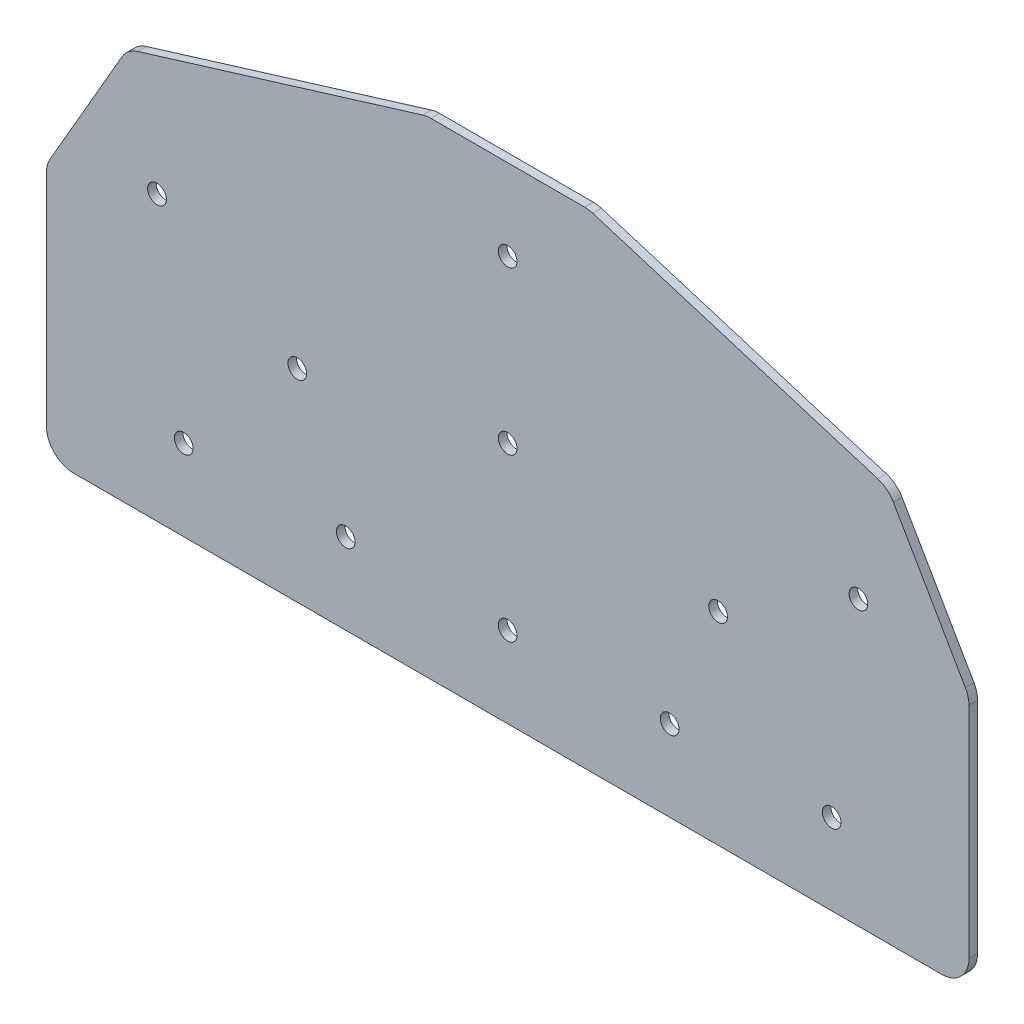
ISO-10303-21;
HEADER;
FILE_DESCRIPTION(('STEP AP214'),'2;1');
FILE_NAME('part.step','',(''),(''),'','','');
FILE_SCHEMA(('AUTOMOTIVE_DESIGN { 1 0 10303 214 1 1 1 1 }'));
ENDSEC;
DATA;
#1=APPLICATION_CONTEXT('core data for automotive mechanical design processes');
#2=APPLICATION_PROTOCOL_DEFINITION('international standard','automotive_design',2000,#1);
#3=PRODUCT_CONTEXT('',#1,'mechanical');
#4=PRODUCT('Part','Part','',(#3));
#5=PRODUCT_RELATED_PRODUCT_CATEGORY('part','',(#4));
#6=PRODUCT_DEFINITION_FORMATION('','',#4);
#7=PRODUCT_DEFINITION_CONTEXT('part definition',#1,'design');
#8=PRODUCT_DEFINITION('design','',#6,#7);
#9=PRODUCT_DEFINITION_SHAPE('','',#8);
#10=(LENGTH_UNIT() NAMED_UNIT(*) SI_UNIT(.MILLI.,.METRE.));
#11=(NAMED_UNIT(*) PLANE_ANGLE_UNIT() SI_UNIT($,.RADIAN.));
#12=(NAMED_UNIT(*) SI_UNIT($,.STERADIAN.) SOLID_ANGLE_UNIT());
#13=UNCERTAINTY_MEASURE_WITH_UNIT(LENGTH_MEASURE(1.E-05),#10,'distance_accuracy_value','');
#14=(GEOMETRIC_REPRESENTATION_CONTEXT(3) GLOBAL_UNCERTAINTY_ASSIGNED_CONTEXT((#13)) GLOBAL_UNIT_ASSIGNED_CONTEXT((#10,
#11,#12)) REPRESENTATION_CONTEXT('',''));
#15=CARTESIAN_POINT('',(0.,0.,0.));
#16=DIRECTION('',(0.,0.,1.));
#17=DIRECTION('',(1.,0.,0.));
#18=AXIS2_PLACEMENT_3D('',#15,#16,#17);
#19=CARTESIAN_POINT('',(81.3837777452,4.841875,0.));
#20=DIRECTION('',(1.,0.,0.));
#21=DIRECTION('',(0.,1.,0.));
#22=AXIS2_PLACEMENT_3D('',#19,#20,#21);
#23=PLANE('',#22);
#24=DIRECTION('',(0.,1.,0.));
#25=VECTOR('',#24,1.);
#26=CARTESIAN_POINT('',(81.3837777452,42.8625,1.524));
#27=LINE('',#26,#25);
#28=CARTESIAN_POINT('',(81.3837777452,4.84187499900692,1.524));
#29=VERTEX_POINT('',#28);
#30=CARTESIAN_POINT('',(81.3837777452,43.4792855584,1.524));
#31=VERTEX_POINT('',#30);
#32=EDGE_CURVE('E253',#29,#31,#27,.T.);
#33=ORIENTED_EDGE('',*,*,#32,.F.);
#34=DIRECTION('',(0.,0.,1.));
#35=VECTOR('',#34,1.);
#36=CARTESIAN_POINT('',(81.3837777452,4.84187499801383,0.762));
#37=LINE('',#36,#35);
#38=CARTESIAN_POINT('',(81.3837777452,4.84187499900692,0.));
#39=VERTEX_POINT('',#38);
#40=EDGE_CURVE('E152',#29,#39,#37,.F.);
#41=ORIENTED_EDGE('',*,*,#40,.T.);
#42=DIRECTION('',(0.,1.,0.));
#43=VECTOR('',#42,1.);
#44=CARTESIAN_POINT('',(81.3837777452,42.8625,0.));
#45=LINE('',#44,#43);
#46=CARTESIAN_POINT('',(81.3837777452,43.4792855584,0.));
#47=VERTEX_POINT('',#46);
#48=EDGE_CURVE('E289',#39,#47,#45,.T.);
#49=ORIENTED_EDGE('',*,*,#48,.T.);
#50=DIRECTION('',(0.,0.,-1.));
#51=VECTOR('',#50,1.);
#52=CARTESIAN_POINT('',(81.3837777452,43.4792855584,0.762));
#53=LINE('',#52,#51);
#54=EDGE_CURVE('E193',#47,#31,#53,.F.);
#55=ORIENTED_EDGE('',*,*,#54,.T.);
#56=EDGE_LOOP('',(#33,#41,#49,#55));
#57=FACE_BOUND('',#56,.T.);
#58=ADVANCED_FACE('F15',(#57),#23,.T.);
#59=CARTESIAN_POINT('',(76.5419027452,43.4792855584,0.));
#60=DIRECTION('',(0.,0.,1.));
#61=DIRECTION('',(1.,0.,0.));
#62=AXIS2_PLACEMENT_3D('',#59,#60,#61);
#63=CYLINDRICAL_SURFACE('',#62,4.84187500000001);
#64=ORIENTED_EDGE('',*,*,#54,.F.);
#65=CARTESIAN_POINT('',(76.5419027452,43.4792855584,0.));
#66=DIRECTION('',(0.,0.,1.));
#67=DIRECTION('',(1.,0.,0.));
#68=AXIS2_PLACEMENT_3D('',#65,#66,#67);
#69=CIRCLE('',#68,4.84187500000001);
#70=CARTESIAN_POINT('',(80.7350894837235,45.9002230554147,0.));
#71=VERTEX_POINT('',#70);
#72=EDGE_CURVE('E286',#47,#71,#69,.T.);
#73=ORIENTED_EDGE('',*,*,#72,.T.);
#74=DIRECTION('',(0.,0.,1.));
#75=VECTOR('',#74,1.);
#76=CARTESIAN_POINT('',(80.735089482,45.9002230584,0.762));
#77=LINE('',#76,#75);
#78=CARTESIAN_POINT('',(80.7350894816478,45.9002230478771,1.524));
#79=VERTEX_POINT('',#78);
#80=EDGE_CURVE('E190',#71,#79,#77,.T.);
#81=ORIENTED_EDGE('',*,*,#80,.T.);
#82=CARTESIAN_POINT('',(76.5419027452,43.4792855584,1.524));
#83=DIRECTION('',(0.,0.,1.));
#84=DIRECTION('',(1.,0.,0.));
#85=AXIS2_PLACEMENT_3D('',#82,#83,#84);
#86=CIRCLE('',#85,4.84187500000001);
#87=EDGE_CURVE('E251',#31,#79,#86,.T.);
#88=ORIENTED_EDGE('',*,*,#87,.F.);
#89=EDGE_LOOP('',(#64,#73,#81,#88));
#90=FACE_BOUND('',#89,.T.);
#91=ADVANCED_FACE('F345',(#90),#63,.T.);
#92=CARTESIAN_POINT('',(68.0485453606,67.873962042,0.));
#93=DIRECTION('',(-0.866025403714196,-0.500000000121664,0.));
#94=DIRECTION('',(0.500000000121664,-0.866025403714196,0.));
#95=AXIS2_PLACEMENT_3D('',#92,#93,#94);
#96=PLANE('',#95);
#97=ORIENTED_EDGE('',*,*,#80,.F.);
#98=DIRECTION('',(0.500000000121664,-0.866025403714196,0.));
#99=VECTOR('',#98,1.);
#100=CARTESIAN_POINT('',(68.0485453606,67.873962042,0.));
#101=LINE('',#100,#99);
#102=CARTESIAN_POINT('',(68.0485453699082,67.8739620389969,0.));
#103=VERTEX_POINT('',#102);
#104=EDGE_CURVE('E284',#71,#103,#101,.F.);
#105=ORIENTED_EDGE('',*,*,#104,.T.);
#106=DIRECTION('',(0.,0.,-1.));
#107=VECTOR('',#106,1.);
#108=CARTESIAN_POINT('',(68.0485453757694,67.8739620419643,0.762));
#109=LINE('',#108,#107);
#110=CARTESIAN_POINT('',(68.048545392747,67.8739620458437,1.524));
#111=VERTEX_POINT('',#110);
#112=EDGE_CURVE('E127',#103,#111,#109,.F.);
#113=ORIENTED_EDGE('',*,*,#112,.T.);
#114=DIRECTION('',(-0.499999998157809,0.866025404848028,0.));
#115=VECTOR('',#114,1.);
#116=CARTESIAN_POINT('',(80.7350894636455,45.900223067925,1.524));
#117=LINE('',#116,#115);
#118=EDGE_CURVE('E249',#79,#111,#117,.T.);
#119=ORIENTED_EDGE('',*,*,#118,.F.);
#120=EDGE_LOOP('',(#97,#105,#113,#119));
#121=FACE_BOUND('',#120,.T.);
#122=ADVANCED_FACE('F348',(#121),#96,.F.);
#123=CARTESIAN_POINT('',(63.8553586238,65.453024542,1.524));
#124=DIRECTION('',(0.,0.,-1.));
#125=DIRECTION('',(0.,1.,0.));
#126=AXIS2_PLACEMENT_3D('',#123,#124,#125);
#127=CYLINDRICAL_SURFACE('',#126,4.84187500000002);
#128=ORIENTED_EDGE('',*,*,#112,.F.);
#129=CARTESIAN_POINT('',(63.8553586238,65.453024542,0.));
#130=DIRECTION('',(0.,0.,-1.));
#131=DIRECTION('',(0.,1.,0.));
#132=AXIS2_PLACEMENT_3D('',#129,#130,#131);
#133=CIRCLE('',#132,4.84187500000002);
#134=CARTESIAN_POINT('',(65.2755061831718,70.0819482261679,0.));
#135=VERTEX_POINT('',#134);
#136=EDGE_CURVE('E19',#103,#135,#133,.F.);
#137=ORIENTED_EDGE('',*,*,#136,.T.);
#138=DIRECTION('',(0.,0.,1.));
#139=VECTOR('',#138,1.);
#140=CARTESIAN_POINT('',(65.2755061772,70.081948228,0.762));
#141=LINE('',#140,#139);
#142=CARTESIAN_POINT('',(65.2755061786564,70.081948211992,1.524));
#143=VERTEX_POINT('',#142);
#144=EDGE_CURVE('E134',#135,#143,#141,.T.);
#145=ORIENTED_EDGE('',*,*,#144,.T.);
#146=CARTESIAN_POINT('',(63.8553586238,65.453024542,1.524));
#147=DIRECTION('',(0.,0.,-1.));
#148=DIRECTION('',(0.,1.,0.));
#149=AXIS2_PLACEMENT_3D('',#146,#147,#148);
#150=CIRCLE('',#149,4.84187500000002);
#151=EDGE_CURVE('E247',#111,#143,#150,.F.);
#152=ORIENTED_EDGE('',*,*,#151,.F.);
#153=EDGE_LOOP('',(#128,#137,#145,#152));
#154=FACE_BOUND('',#153,.T.);
#155=ADVANCED_FACE('F151',(#154),#127,.T.);
#156=CARTESIAN_POINT('',(14.9816077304,85.512048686,0.));
#157=DIRECTION('',(-0.293305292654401,-0.956018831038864,0.));
#158=DIRECTION('',(0.956018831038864,-0.293305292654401,0.));
#159=AXIS2_PLACEMENT_3D('',#156,#157,#158);
#160=PLANE('',#159);
#161=ORIENTED_EDGE('',*,*,#144,.F.);
#162=DIRECTION('',(0.956018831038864,-0.293305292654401,0.));
#163=VECTOR('',#162,1.);
#164=CARTESIAN_POINT('',(14.9816077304,85.512048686,0.));
#165=LINE('',#164,#163);
#166=CARTESIAN_POINT('',(14.981607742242,85.5120486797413,0.));
#167=VERTEX_POINT('',#166);
#168=EDGE_CURVE('E138',#135,#167,#165,.F.);
#169=ORIENTED_EDGE('',*,*,#168,.T.);
#170=DIRECTION('',(0.,0.,-1.));
#171=VECTOR('',#170,1.);
#172=CARTESIAN_POINT('',(14.9816077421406,85.5120486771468,0.762));
#173=LINE('',#172,#171);
#174=CARTESIAN_POINT('',(14.9816077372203,85.5120486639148,1.524));
#175=VERTEX_POINT('',#174);
#176=EDGE_CURVE('E140',#167,#175,#173,.F.);
#177=ORIENTED_EDGE('',*,*,#176,.T.);
#178=DIRECTION('',(-0.956018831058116,0.293305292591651,0.));
#179=VECTOR('',#178,1.);
#180=CARTESIAN_POINT('',(65.2755061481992,70.081948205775,1.524));
#181=LINE('',#180,#179);
#182=EDGE_CURVE('E139',#143,#175,#181,.T.);
#183=ORIENTED_EDGE('',*,*,#182,.F.);
#184=EDGE_LOOP('',(#161,#169,#177,#183));
#185=FACE_BOUND('',#184,.T.);
#186=ADVANCED_FACE('F136',(#185),#160,.F.);
#187=CARTESIAN_POINT('',(13.561460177,80.883125,1.524));
#188=DIRECTION('',(0.,0.,-1.));
#189=DIRECTION('',(0.,1.,0.));
#190=AXIS2_PLACEMENT_3D('',#187,#188,#189);
#191=CYLINDRICAL_SURFACE('',#190,4.841875);
#192=ORIENTED_EDGE('',*,*,#176,.F.);
#193=CARTESIAN_POINT('',(13.561460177,80.883125,0.));
#194=DIRECTION('',(0.,0.,-1.));
#195=DIRECTION('',(0.,1.,0.));
#196=AXIS2_PLACEMENT_3D('',#193,#194,#195);
#197=CIRCLE('',#196,4.841875);
#198=CARTESIAN_POINT('',(13.561460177,85.725,0.));
#199=VERTEX_POINT('',#198);
#200=EDGE_CURVE('E150',#167,#199,#197,.F.);
#201=ORIENTED_EDGE('',*,*,#200,.T.);
#202=DIRECTION('',(0.,0.,1.));
#203=VECTOR('',#202,1.);
#204=CARTESIAN_POINT('',(13.561460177,85.725,0.762));
#205=LINE('',#204,#203);
#206=CARTESIAN_POINT('',(13.561460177,85.725,1.524));
#207=VERTEX_POINT('',#206);
#208=EDGE_CURVE('E185',#199,#207,#205,.T.);
#209=ORIENTED_EDGE('',*,*,#208,.T.);
#210=CARTESIAN_POINT('',(13.561460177,80.883125,1.524));
#211=DIRECTION('',(0.,0.,-1.));
#212=DIRECTION('',(0.,1.,0.));
#213=AXIS2_PLACEMENT_3D('',#210,#211,#212);
#214=CIRCLE('',#213,4.841875);
#215=EDGE_CURVE('E244',#175,#207,#214,.F.);
#216=ORIENTED_EDGE('',*,*,#215,.F.);
#217=EDGE_LOOP('',(#192,#201,#209,#216));
#218=FACE_BOUND('',#217,.T.);
#219=ADVANCED_FACE('F371',(#218),#191,.T.);
#220=CARTESIAN_POINT('',(-13.561460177,85.725,1.524));
#221=DIRECTION('',(0.,-1.,0.));
#222=DIRECTION('',(0.,0.,-1.));
#223=AXIS2_PLACEMENT_3D('',#220,#221,#222);
#224=PLANE('',#223);
#225=ORIENTED_EDGE('',*,*,#208,.F.);
#226=DIRECTION('',(-1.,0.,0.));
#227=VECTOR('',#226,1.);
#228=CARTESIAN_POINT('',(0.,85.725,0.));
#229=LINE('',#228,#227);
#230=CARTESIAN_POINT('',(-13.5614601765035,85.725,0.));
#231=VERTEX_POINT('',#230);
#232=EDGE_CURVE('E313',#199,#231,#229,.T.);
#233=ORIENTED_EDGE('',*,*,#232,.T.);
#234=DIRECTION('',(0.,0.,-1.));
#235=VECTOR('',#234,1.);
#236=CARTESIAN_POINT('',(-13.5614601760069,85.725,0.762));
#237=LINE('',#236,#235);
#238=CARTESIAN_POINT('',(-13.5614601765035,85.725,1.524));
#239=VERTEX_POINT('',#238);
#240=EDGE_CURVE('E182',#231,#239,#237,.F.);
#241=ORIENTED_EDGE('',*,*,#240,.T.);
#242=DIRECTION('',(-1.,0.,0.));
#243=VECTOR('',#242,1.);
#244=CARTESIAN_POINT('',(0.,85.725,1.524));
#245=LINE('',#244,#243);
#246=EDGE_CURVE('E243',#207,#239,#245,.T.);
#247=ORIENTED_EDGE('',*,*,#246,.F.);
#248=EDGE_LOOP('',(#225,#233,#241,#247));
#249=FACE_BOUND('',#248,.T.);
#250=ADVANCED_FACE('F369',(#249),#224,.F.);
#251=CARTESIAN_POINT('',(-13.561460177,80.883125,1.524));
#252=DIRECTION('',(0.,0.,-1.));
#253=DIRECTION('',(0.,1.,0.));
#254=AXIS2_PLACEMENT_3D('',#251,#252,#253);
#255=CYLINDRICAL_SURFACE('',#254,4.841875);
#256=ORIENTED_EDGE('',*,*,#240,.F.);
#257=CARTESIAN_POINT('',(-13.561460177,80.883125,0.));
#258=DIRECTION('',(0.,0.,-1.));
#259=DIRECTION('',(0.,1.,0.));
#260=AXIS2_PLACEMENT_3D('',#257,#258,#259);
#261=CIRCLE('',#260,4.841875);
#262=CARTESIAN_POINT('',(-14.9816077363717,85.5120486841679,0.));
#263=VERTEX_POINT('',#262);
#264=EDGE_CURVE('E310',#231,#263,#261,.F.);
#265=ORIENTED_EDGE('',*,*,#264,.T.);
#266=DIRECTION('',(0.,0.,1.));
#267=VECTOR('',#266,1.);
#268=CARTESIAN_POINT('',(-14.9816077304,85.512048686,0.762));
#269=LINE('',#268,#267);
#270=CARTESIAN_POINT('',(-14.98160773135,85.5120486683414,1.524));
#271=VERTEX_POINT('',#270);
#272=EDGE_CURVE('E179',#263,#271,#269,.T.);
#273=ORIENTED_EDGE('',*,*,#272,.T.);
#274=CARTESIAN_POINT('',(-13.561460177,80.883125,1.524));
#275=DIRECTION('',(0.,0.,-1.));
#276=DIRECTION('',(0.,1.,0.));
#277=AXIS2_PLACEMENT_3D('',#274,#275,#276);
#278=CIRCLE('',#277,4.841875);
#279=EDGE_CURVE('E241',#239,#271,#278,.F.);
#280=ORIENTED_EDGE('',*,*,#279,.F.);
#281=EDGE_LOOP('',(#256,#265,#273,#280));
#282=FACE_BOUND('',#281,.T.);
#283=ADVANCED_FACE('F366',(#282),#255,.T.);
#284=CARTESIAN_POINT('',(-65.2755061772,70.081948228,0.));
#285=DIRECTION('',(0.293305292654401,-0.956018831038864,0.));
#286=DIRECTION('',(0.956018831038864,0.293305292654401,0.));
#287=AXIS2_PLACEMENT_3D('',#284,#285,#286);
#288=PLANE('',#287);
#289=ORIENTED_EDGE('',*,*,#272,.F.);
#290=DIRECTION('',(0.956018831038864,0.293305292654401,0.));
#291=VECTOR('',#290,1.);
#292=CARTESIAN_POINT('',(-65.2755061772,70.081948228,0.));
#293=LINE('',#292,#291);
#294=CARTESIAN_POINT('',(-65.2755061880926,70.0819482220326,0.));
#295=VERTEX_POINT('',#294);
#296=EDGE_CURVE('E307',#263,#295,#293,.F.);
#297=ORIENTED_EDGE('',*,*,#296,.T.);
#298=DIRECTION('',(0.,0.,-1.));
#299=VECTOR('',#298,1.);
#300=CARTESIAN_POINT('',(-65.2755061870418,70.0819482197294,0.762));
#301=LINE('',#300,#299);
#302=CARTESIAN_POINT('',(-65.2755061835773,70.0819482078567,1.524));
#303=VERTEX_POINT('',#302);
#304=EDGE_CURVE('E176',#295,#303,#301,.F.);
#305=ORIENTED_EDGE('',*,*,#304,.T.);
#306=DIRECTION('',(-0.956018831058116,-0.293305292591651,0.));
#307=VECTOR('',#306,1.);
#308=CARTESIAN_POINT('',(-14.9816077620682,85.51204864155,1.524));
#309=LINE('',#308,#307);
#310=EDGE_CURVE('E239',#271,#303,#309,.T.);
#311=ORIENTED_EDGE('',*,*,#310,.F.);
#312=EDGE_LOOP('',(#289,#297,#305,#311));
#313=FACE_BOUND('',#312,.T.);
#314=ADVANCED_FACE('F363',(#313),#288,.F.);
#315=CARTESIAN_POINT('',(-63.8553586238,65.453024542,1.524));
#316=DIRECTION('',(0.,0.,-1.));
#317=DIRECTION('',(0.,1.,0.));
#318=AXIS2_PLACEMENT_3D('',#315,#316,#317);
#319=CYLINDRICAL_SURFACE('',#318,4.841875);
#320=ORIENTED_EDGE('',*,*,#304,.F.);
#321=CARTESIAN_POINT('',(-63.8553586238,65.453024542,0.));
#322=DIRECTION('',(0.,0.,-1.));
#323=DIRECTION('',(0.,1.,0.));
#324=AXIS2_PLACEMENT_3D('',#321,#322,#323);
#325=CIRCLE('',#324,4.841875);
#326=CARTESIAN_POINT('',(-68.0485453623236,67.8739620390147,0.));
#327=VERTEX_POINT('',#326);
#328=EDGE_CURVE('E304',#295,#327,#325,.F.);
#329=ORIENTED_EDGE('',*,*,#328,.T.);
#330=DIRECTION('',(0.,0.,1.));
#331=VECTOR('',#330,1.);
#332=CARTESIAN_POINT('',(-68.0485453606,67.873962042,0.762));
#333=LINE('',#332,#331);
#334=CARTESIAN_POINT('',(-68.0485453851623,67.8739620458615,1.524));
#335=VERTEX_POINT('',#334);
#336=EDGE_CURVE('E173',#327,#335,#333,.T.);
#337=ORIENTED_EDGE('',*,*,#336,.T.);
#338=CARTESIAN_POINT('',(-63.8553586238,65.453024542,1.524));
#339=DIRECTION('',(0.,0.,-1.));
#340=DIRECTION('',(0.,1.,0.));
#341=AXIS2_PLACEMENT_3D('',#338,#339,#340);
#342=CIRCLE('',#341,4.841875);
#343=EDGE_CURVE('E237',#303,#335,#342,.F.);
#344=ORIENTED_EDGE('',*,*,#343,.F.);
#345=EDGE_LOOP('',(#320,#329,#337,#344));
#346=FACE_BOUND('',#345,.T.);
#347=ADVANCED_FACE('F359',(#346),#319,.T.);
#348=CARTESIAN_POINT('',(-80.735089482,45.9002230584,0.));
#349=DIRECTION('',(0.866025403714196,-0.500000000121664,0.));
#350=DIRECTION('',(0.500000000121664,0.866025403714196,0.));
#351=AXIS2_PLACEMENT_3D('',#348,#349,#350);
#352=PLANE('',#351);
#353=DIRECTION('',(0.,0.,-1.));
#354=VECTOR('',#353,1.);
#355=CARTESIAN_POINT('',(-80.7350894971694,45.9002230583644,0.762));
#356=LINE('',#355,#354);
#357=CARTESIAN_POINT('',(-80.7350894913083,45.9002230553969,0.));
#358=VERTEX_POINT('',#357);
#359=CARTESIAN_POINT('',(-80.7350894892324,45.9002230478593,1.524));
#360=VERTEX_POINT('',#359);
#361=EDGE_CURVE('E170',#358,#360,#356,.F.);
#362=ORIENTED_EDGE('',*,*,#361,.T.);
#363=DIRECTION('',(-0.49999999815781,-0.866025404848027,0.));
#364=VECTOR('',#363,1.);
#365=CARTESIAN_POINT('',(-68.0485454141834,67.873962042,1.524));
#366=LINE('',#365,#364);
#367=EDGE_CURVE('E235',#335,#360,#366,.T.);
#368=ORIENTED_EDGE('',*,*,#367,.F.);
#369=ORIENTED_EDGE('',*,*,#336,.F.);
#370=DIRECTION('',(0.500000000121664,0.866025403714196,0.));
#371=VECTOR('',#370,1.);
#372=CARTESIAN_POINT('',(-80.735089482,45.9002230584,0.));
#373=LINE('',#372,#371);
#374=EDGE_CURVE('E301',#327,#358,#373,.F.);
#375=ORIENTED_EDGE('',*,*,#374,.T.);
#376=EDGE_LOOP('',(#362,#368,#369,#375));
#377=FACE_BOUND('',#376,.T.);
#378=ADVANCED_FACE('F355',(#377),#352,.F.);
#379=CARTESIAN_POINT('',(-76.5419027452,43.4792855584,0.));
#380=DIRECTION('',(0.,0.,1.));
#381=DIRECTION('',(1.,0.,0.));
#382=AXIS2_PLACEMENT_3D('',#379,#380,#381);
#383=CYLINDRICAL_SURFACE('',#382,4.84187500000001);
#384=ORIENTED_EDGE('',*,*,#361,.F.);
#385=CARTESIAN_POINT('',(-76.5419027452,43.4792855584,0.));
#386=DIRECTION('',(0.,0.,1.));
#387=DIRECTION('',(1.,0.,0.));
#388=AXIS2_PLACEMENT_3D('',#385,#386,#387);
#389=CIRCLE('',#388,4.84187500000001);
#390=CARTESIAN_POINT('',(-81.3837777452,43.4792855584,0.));
#391=VERTEX_POINT('',#390);
#392=EDGE_CURVE('E298',#358,#391,#389,.T.);
#393=ORIENTED_EDGE('',*,*,#392,.T.);
#394=DIRECTION('',(0.,0.,-1.));
#395=VECTOR('',#394,1.);
#396=CARTESIAN_POINT('',(-81.3837777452,43.4792855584,0.762));
#397=LINE('',#396,#395);
#398=CARTESIAN_POINT('',(-81.3837777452,43.4792855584,1.524));
#399=VERTEX_POINT('',#398);
#400=EDGE_CURVE('E168',#399,#391,#397,.T.);
#401=ORIENTED_EDGE('',*,*,#400,.F.);
#402=CARTESIAN_POINT('',(-76.5419027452,43.4792855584,1.524));
#403=DIRECTION('',(0.,0.,1.));
#404=DIRECTION('',(1.,0.,0.));
#405=AXIS2_PLACEMENT_3D('',#402,#403,#404);
#406=CIRCLE('',#405,4.84187500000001);
#407=EDGE_CURVE('E233',#360,#399,#406,.T.);
#408=ORIENTED_EDGE('',*,*,#407,.F.);
#409=EDGE_LOOP('',(#384,#393,#401,#408));
#410=FACE_BOUND('',#409,.T.);
#411=ADVANCED_FACE('F352',(#410),#383,.T.);
#412=CARTESIAN_POINT('',(-81.3837777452,4.841875,0.));
#413=DIRECTION('',(-1.,0.,0.));
#414=DIRECTION('',(0.,0.,1.));
#415=AXIS2_PLACEMENT_3D('',#412,#413,#414);
#416=PLANE('',#415);
#417=DIRECTION('',(0.,-1.,0.));
#418=VECTOR('',#417,1.);
#419=CARTESIAN_POINT('',(-81.3837777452,42.8625,0.));
#420=LINE('',#419,#418);
#421=CARTESIAN_POINT('',(-81.3837777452,4.84187499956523,0.));
#422=VERTEX_POINT('',#421);
#423=EDGE_CURVE('E297',#391,#422,#420,.T.);
#424=ORIENTED_EDGE('',*,*,#423,.T.);
#425=DIRECTION('',(0.,0.,-1.));
#426=VECTOR('',#425,1.);
#427=CARTESIAN_POINT('',(-81.3837777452,4.84187499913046,0.762));
#428=LINE('',#427,#426);
#429=CARTESIAN_POINT('',(-81.3837777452,4.84187499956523,1.524));
#430=VERTEX_POINT('',#429);
#431=EDGE_CURVE('E165',#422,#430,#428,.F.);
#432=ORIENTED_EDGE('',*,*,#431,.T.);
#433=DIRECTION('',(0.,-1.,0.));
#434=VECTOR('',#433,1.);
#435=CARTESIAN_POINT('',(-81.3837777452,42.8625,1.524));
#436=LINE('',#435,#434);
#437=EDGE_CURVE('E232',#399,#430,#436,.T.);
#438=ORIENTED_EDGE('',*,*,#437,.F.);
#439=ORIENTED_EDGE('',*,*,#400,.T.);
#440=EDGE_LOOP('',(#424,#432,#438,#439));
#441=FACE_BOUND('',#440,.T.);
#442=ADVANCED_FACE('F331',(#441),#416,.T.);
#443=CARTESIAN_POINT('',(-76.5419027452,4.841875,1.524));
#444=DIRECTION('',(0.,0.,-1.));
#445=DIRECTION('',(0.,1.,0.));
#446=AXIS2_PLACEMENT_3D('',#443,#444,#445);
#447=CYLINDRICAL_SURFACE('',#446,4.84187500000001);
#448=DIRECTION('',(0.,0.,1.));
#449=VECTOR('',#448,1.);
#450=CARTESIAN_POINT('',(-76.5419027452,0.,0.762));
#451=LINE('',#450,#449);
#452=CARTESIAN_POINT('',(-76.5419027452,0.,0.));
#453=VERTEX_POINT('',#452);
#454=CARTESIAN_POINT('',(-76.5419027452,0.,1.524));
#455=VERTEX_POINT('',#454);
#456=EDGE_CURVE('E159',#453,#455,#451,.T.);
#457=ORIENTED_EDGE('',*,*,#456,.T.);
#458=CARTESIAN_POINT('',(-76.5419027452,4.841875,1.524));
#459=DIRECTION('',(0.,0.,-1.));
#460=DIRECTION('',(0.,1.,0.));
#461=AXIS2_PLACEMENT_3D('',#458,#459,#460);
#462=CIRCLE('',#461,4.84187500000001);
#463=EDGE_CURVE('E230',#430,#455,#462,.F.);
#464=ORIENTED_EDGE('',*,*,#463,.F.);
#465=ORIENTED_EDGE('',*,*,#431,.F.);
#466=CARTESIAN_POINT('',(-76.5419027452,4.841875,0.));
#467=DIRECTION('',(0.,0.,-1.));
#468=DIRECTION('',(0.,1.,0.));
#469=AXIS2_PLACEMENT_3D('',#466,#467,#468);
#470=CIRCLE('',#469,4.84187500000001);
#471=EDGE_CURVE('E294',#422,#453,#470,.F.);
#472=ORIENTED_EDGE('',*,*,#471,.T.);
#473=EDGE_LOOP('',(#457,#464,#465,#472));
#474=FACE_BOUND('',#473,.T.);
#475=ADVANCED_FACE('F335',(#474),#447,.T.);
#476=CARTESIAN_POINT('',(76.5419027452,0.,0.));
#477=DIRECTION('',(0.,1.,0.));
#478=DIRECTION('',(-1.,0.,0.));
#479=AXIS2_PLACEMENT_3D('',#476,#477,#478);
#480=PLANE('',#479);
#481=DIRECTION('',(0.,0.,-1.));
#482=VECTOR('',#481,1.);
#483=CARTESIAN_POINT('',(76.5419027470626,0.,0.762));
#484=LINE('',#483,#482);
#485=CARTESIAN_POINT('',(76.5419027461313,0.,0.));
#486=VERTEX_POINT('',#485);
#487=CARTESIAN_POINT('',(76.5419027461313,0.,1.524));
#488=VERTEX_POINT('',#487);
#489=EDGE_CURVE('E153',#486,#488,#484,.F.);
#490=ORIENTED_EDGE('',*,*,#489,.T.);
#491=DIRECTION('',(1.,0.,0.));
#492=VECTOR('',#491,1.);
#493=CARTESIAN_POINT('',(0.,0.,1.524));
#494=LINE('',#493,#492);
#495=EDGE_CURVE('E34',#455,#488,#494,.T.);
#496=ORIENTED_EDGE('',*,*,#495,.F.);
#497=ORIENTED_EDGE('',*,*,#456,.F.);
#498=DIRECTION('',(1.,0.,0.));
#499=VECTOR('',#498,1.);
#500=CARTESIAN_POINT('',(0.,0.,0.));
#501=LINE('',#500,#499);
#502=EDGE_CURVE('E293',#453,#486,#501,.T.);
#503=ORIENTED_EDGE('',*,*,#502,.T.);
#504=EDGE_LOOP('',(#490,#496,#497,#503));
#505=FACE_BOUND('',#504,.T.);
#506=ADVANCED_FACE('F338',(#505),#480,.F.);
#507=CARTESIAN_POINT('',(76.5419027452,4.841875,1.524));
#508=DIRECTION('',(0.,0.,-1.));
#509=DIRECTION('',(0.,1.,0.));
#510=AXIS2_PLACEMENT_3D('',#507,#508,#509);
#511=CYLINDRICAL_SURFACE('',#510,4.84187500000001);
#512=ORIENTED_EDGE('',*,*,#40,.F.);
#513=CARTESIAN_POINT('',(76.5419027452,4.841875,1.524));
#514=DIRECTION('',(0.,0.,-1.));
#515=DIRECTION('',(0.,1.,0.));
#516=AXIS2_PLACEMENT_3D('',#513,#514,#515);
#517=CIRCLE('',#516,4.84187500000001);
#518=EDGE_CURVE('E228',#488,#29,#517,.F.);
#519=ORIENTED_EDGE('',*,*,#518,.F.);
#520=ORIENTED_EDGE('',*,*,#489,.F.);
#521=CARTESIAN_POINT('',(76.5419027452,4.841875,0.));
#522=DIRECTION('',(0.,0.,-1.));
#523=DIRECTION('',(0.,1.,0.));
#524=AXIS2_PLACEMENT_3D('',#521,#522,#523);
#525=CIRCLE('',#524,4.84187500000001);
#526=EDGE_CURVE('E290',#486,#39,#525,.F.);
#527=ORIENTED_EDGE('',*,*,#526,.T.);
#528=EDGE_LOOP('',(#512,#519,#520,#527));
#529=FACE_BOUND('',#528,.T.);
#530=ADVANCED_FACE('F342',(#529),#511,.T.);
#531=CARTESIAN_POINT('',(0.,71.4375,0.));
#532=DIRECTION('',(0.,0.,1.));
#533=DIRECTION('',(1.,0.,0.));
#534=AXIS2_PLACEMENT_3D('',#531,#532,#533);
#535=CYLINDRICAL_SURFACE('',#534,1.651);
#536=CARTESIAN_POINT('',(0.,71.4375,1.524));
#537=DIRECTION('',(0.,0.,1.));
#538=DIRECTION('',(1.,0.,0.));
#539=AXIS2_PLACEMENT_3D('',#536,#537,#538);
#540=CIRCLE('',#539,1.651);
#541=CARTESIAN_POINT('',(1.651,71.4375,1.524));
#542=VERTEX_POINT('',#541);
#543=EDGE_CURVE('E225',#542,#542,#540,.F.);
#544=ORIENTED_EDGE('',*,*,#543,.F.);
#545=EDGE_LOOP('',(#544));
#546=FACE_BOUND('',#545,.T.);
#547=CARTESIAN_POINT('',(0.,71.4375,0.));
#548=DIRECTION('',(0.,0.,1.));
#549=DIRECTION('',(1.,0.,0.));
#550=AXIS2_PLACEMENT_3D('',#547,#548,#549);
#551=CIRCLE('',#550,1.651);
#552=CARTESIAN_POINT('',(1.651,71.4375,0.));
#553=VERTEX_POINT('',#552);
#554=EDGE_CURVE('E281',#553,#553,#551,.F.);
#555=ORIENTED_EDGE('',*,*,#554,.T.);
#556=EDGE_LOOP('',(#555));
#557=FACE_BOUND('',#556,.T.);
#558=ADVANCED_FACE('F428',(#546,#557),#535,.F.);
#559=CARTESIAN_POINT('',(0.,42.8625,0.));
#560=DIRECTION('',(0.,0.,1.));
#561=DIRECTION('',(1.,0.,0.));
#562=AXIS2_PLACEMENT_3D('',#559,#560,#561);
#563=CYLINDRICAL_SURFACE('',#562,1.651);
#564=CARTESIAN_POINT('',(0.,42.8625,1.524));
#565=DIRECTION('',(0.,0.,1.));
#566=DIRECTION('',(1.,0.,0.));
#567=AXIS2_PLACEMENT_3D('',#564,#565,#566);
#568=CIRCLE('',#567,1.651);
#569=CARTESIAN_POINT('',(1.651,42.8625,1.524));
#570=VERTEX_POINT('',#569);
#571=EDGE_CURVE('E222',#570,#570,#568,.F.);
#572=ORIENTED_EDGE('',*,*,#571,.F.);
#573=EDGE_LOOP('',(#572));
#574=FACE_BOUND('',#573,.T.);
#575=CARTESIAN_POINT('',(0.,42.8625,0.));
#576=DIRECTION('',(0.,0.,1.));
#577=DIRECTION('',(1.,0.,0.));
#578=AXIS2_PLACEMENT_3D('',#575,#576,#577);
#579=CIRCLE('',#578,1.651);
#580=CARTESIAN_POINT('',(1.651,42.8625,0.));
#581=VERTEX_POINT('',#580);
#582=EDGE_CURVE('E278',#581,#581,#579,.F.);
#583=ORIENTED_EDGE('',*,*,#582,.T.);
#584=EDGE_LOOP('',(#583));
#585=FACE_BOUND('',#584,.T.);
#586=ADVANCED_FACE('F424',(#574,#585),#563,.F.);
#587=CARTESIAN_POINT('',(-57.15,14.2875,0.));
#588=DIRECTION('',(0.,0.,1.));
#589=DIRECTION('',(1.,0.,0.));
#590=AXIS2_PLACEMENT_3D('',#587,#588,#589);
#591=CYLINDRICAL_SURFACE('',#590,1.651);
#592=CARTESIAN_POINT('',(-57.15,14.2875,1.524));
#593=DIRECTION('',(0.,0.,1.));
#594=DIRECTION('',(1.,0.,0.));
#595=AXIS2_PLACEMENT_3D('',#592,#593,#594);
#596=CIRCLE('',#595,1.651);
#597=CARTESIAN_POINT('',(-55.499,14.2875,1.524));
#598=VERTEX_POINT('',#597);
#599=EDGE_CURVE('E219',#598,#598,#596,.F.);
#600=ORIENTED_EDGE('',*,*,#599,.F.);
#601=EDGE_LOOP('',(#600));
#602=FACE_BOUND('',#601,.T.);
#603=CARTESIAN_POINT('',(-57.15,14.2875,0.));
#604=DIRECTION('',(0.,0.,1.));
#605=DIRECTION('',(1.,0.,0.));
#606=AXIS2_PLACEMENT_3D('',#603,#604,#605);
#607=CIRCLE('',#606,1.651);
#608=CARTESIAN_POINT('',(-55.499,14.2875,0.));
#609=VERTEX_POINT('',#608);
#610=EDGE_CURVE('E275',#609,#609,#607,.F.);
#611=ORIENTED_EDGE('',*,*,#610,.T.);
#612=EDGE_LOOP('',(#611));
#613=FACE_BOUND('',#612,.T.);
#614=ADVANCED_FACE('F420',(#602,#613),#591,.F.);
#615=CARTESIAN_POINT('',(57.15,14.2875,0.));
#616=DIRECTION('',(0.,0.,1.));
#617=DIRECTION('',(1.,0.,0.));
#618=AXIS2_PLACEMENT_3D('',#615,#616,#617);
#619=CYLINDRICAL_SURFACE('',#618,1.65099999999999);
#620=CARTESIAN_POINT('',(57.15,14.2875,1.524));
#621=DIRECTION('',(0.,0.,1.));
#622=DIRECTION('',(1.,0.,0.));
#623=AXIS2_PLACEMENT_3D('',#620,#621,#622);
#624=CIRCLE('',#623,1.65099999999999);
#625=CARTESIAN_POINT('',(58.801,14.2875,1.524));
#626=VERTEX_POINT('',#625);
#627=EDGE_CURVE('E216',#626,#626,#624,.F.);
#628=ORIENTED_EDGE('',*,*,#627,.F.);
#629=EDGE_LOOP('',(#628));
#630=FACE_BOUND('',#629,.T.);
#631=CARTESIAN_POINT('',(57.15,14.2875,0.));
#632=DIRECTION('',(0.,0.,1.));
#633=DIRECTION('',(1.,0.,0.));
#634=AXIS2_PLACEMENT_3D('',#631,#632,#633);
#635=CIRCLE('',#634,1.65099999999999);
#636=CARTESIAN_POINT('',(58.801,14.2875,0.));
#637=VERTEX_POINT('',#636);
#638=EDGE_CURVE('E272',#637,#637,#635,.F.);
#639=ORIENTED_EDGE('',*,*,#638,.T.);
#640=EDGE_LOOP('',(#639));
#641=FACE_BOUND('',#640,.T.);
#642=ADVANCED_FACE('F416',(#630,#641),#619,.F.);
#643=CARTESIAN_POINT('',(61.8666897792,50.00625,0.));
#644=DIRECTION('',(0.,0.,1.));
#645=DIRECTION('',(1.,0.,0.));
#646=AXIS2_PLACEMENT_3D('',#643,#644,#645);
#647=CYLINDRICAL_SURFACE('',#646,1.65100000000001);
#648=CARTESIAN_POINT('',(61.8666897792,50.00625,1.524));
#649=DIRECTION('',(0.,0.,1.));
#650=DIRECTION('',(1.,0.,0.));
#651=AXIS2_PLACEMENT_3D('',#648,#649,#650);
#652=CIRCLE('',#651,1.65100000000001);
#653=CARTESIAN_POINT('',(63.5176897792,50.00625,1.524));
#654=VERTEX_POINT('',#653);
#655=EDGE_CURVE('E213',#654,#654,#652,.F.);
#656=ORIENTED_EDGE('',*,*,#655,.F.);
#657=EDGE_LOOP('',(#656));
#658=FACE_BOUND('',#657,.T.);
#659=CARTESIAN_POINT('',(61.8666897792,50.00625,0.));
#660=DIRECTION('',(0.,0.,1.));
#661=DIRECTION('',(1.,0.,0.));
#662=AXIS2_PLACEMENT_3D('',#659,#660,#661);
#663=CIRCLE('',#662,1.65100000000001);
#664=CARTESIAN_POINT('',(63.5176897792,50.00625,0.));
#665=VERTEX_POINT('',#664);
#666=EDGE_CURVE('E269',#665,#665,#663,.F.);
#667=ORIENTED_EDGE('',*,*,#666,.T.);
#668=EDGE_LOOP('',(#667));
#669=FACE_BOUND('',#668,.T.);
#670=ADVANCED_FACE('F412',(#658,#669),#647,.F.);
#671=CARTESIAN_POINT('',(37.1200138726,35.71875,0.));
#672=DIRECTION('',(0.,0.,1.));
#673=DIRECTION('',(1.,0.,0.));
#674=AXIS2_PLACEMENT_3D('',#671,#672,#673);
#675=CYLINDRICAL_SURFACE('',#674,1.65100000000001);
#676=CARTESIAN_POINT('',(37.1200138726,35.71875,1.524));
#677=DIRECTION('',(0.,0.,1.));
#678=DIRECTION('',(1.,0.,0.));
#679=AXIS2_PLACEMENT_3D('',#676,#677,#678);
#680=CIRCLE('',#679,1.65100000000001);
#681=CARTESIAN_POINT('',(38.7710138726,35.71875,1.524));
#682=VERTEX_POINT('',#681);
#683=EDGE_CURVE('E210',#682,#682,#680,.F.);
#684=ORIENTED_EDGE('',*,*,#683,.F.);
#685=EDGE_LOOP('',(#684));
#686=FACE_BOUND('',#685,.T.);
#687=CARTESIAN_POINT('',(37.1200138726,35.71875,0.));
#688=DIRECTION('',(0.,0.,1.));
#689=DIRECTION('',(1.,0.,0.));
#690=AXIS2_PLACEMENT_3D('',#687,#688,#689);
#691=CIRCLE('',#690,1.65100000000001);
#692=CARTESIAN_POINT('',(38.7710138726,35.71875,0.));
#693=VERTEX_POINT('',#692);
#694=EDGE_CURVE('E266',#693,#693,#691,.F.);
#695=ORIENTED_EDGE('',*,*,#694,.T.);
#696=EDGE_LOOP('',(#695));
#697=FACE_BOUND('',#696,.T.);
#698=ADVANCED_FACE('F408',(#686,#697),#675,.F.);
#699=CARTESIAN_POINT('',(-61.8666897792,50.00625,0.));
#700=DIRECTION('',(0.,0.,1.));
#701=DIRECTION('',(1.,0.,0.));
#702=AXIS2_PLACEMENT_3D('',#699,#700,#701);
#703=CYLINDRICAL_SURFACE('',#702,1.65099999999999);
#704=CARTESIAN_POINT('',(-61.8666897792,50.00625,1.524));
#705=DIRECTION('',(0.,0.,1.));
#706=DIRECTION('',(1.,0.,0.));
#707=AXIS2_PLACEMENT_3D('',#704,#705,#706);
#708=CIRCLE('',#707,1.65099999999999);
#709=CARTESIAN_POINT('',(-60.2156897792,50.00625,1.524));
#710=VERTEX_POINT('',#709);
#711=EDGE_CURVE('E207',#710,#710,#708,.F.);
#712=ORIENTED_EDGE('',*,*,#711,.F.);
#713=EDGE_LOOP('',(#712));
#714=FACE_BOUND('',#713,.T.);
#715=CARTESIAN_POINT('',(-61.8666897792,50.00625,0.));
#716=DIRECTION('',(0.,0.,1.));
#717=DIRECTION('',(1.,0.,0.));
#718=AXIS2_PLACEMENT_3D('',#715,#716,#717);
#719=CIRCLE('',#718,1.65099999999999);
#720=CARTESIAN_POINT('',(-60.2156897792,50.00625,0.));
#721=VERTEX_POINT('',#720);
#722=EDGE_CURVE('E263',#721,#721,#719,.F.);
#723=ORIENTED_EDGE('',*,*,#722,.T.);
#724=EDGE_LOOP('',(#723));
#725=FACE_BOUND('',#724,.T.);
#726=ADVANCED_FACE('F404',(#714,#725),#703,.F.);
#727=CARTESIAN_POINT('',(-37.1200138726,35.71875,0.));
#728=DIRECTION('',(0.,0.,1.));
#729=DIRECTION('',(1.,0.,0.));
#730=AXIS2_PLACEMENT_3D('',#727,#728,#729);
#731=CYLINDRICAL_SURFACE('',#730,1.65099999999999);
#732=CARTESIAN_POINT('',(-37.1200138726,35.71875,1.524));
#733=DIRECTION('',(0.,0.,1.));
#734=DIRECTION('',(1.,0.,0.));
#735=AXIS2_PLACEMENT_3D('',#732,#733,#734);
#736=CIRCLE('',#735,1.65099999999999);
#737=CARTESIAN_POINT('',(-35.4690138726,35.71875,1.524));
#738=VERTEX_POINT('',#737);
#739=EDGE_CURVE('E204',#738,#738,#736,.F.);
#740=ORIENTED_EDGE('',*,*,#739,.F.);
#741=EDGE_LOOP('',(#740));
#742=FACE_BOUND('',#741,.T.);
#743=CARTESIAN_POINT('',(-37.1200138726,35.71875,0.));
#744=DIRECTION('',(0.,0.,1.));
#745=DIRECTION('',(1.,0.,0.));
#746=AXIS2_PLACEMENT_3D('',#743,#744,#745);
#747=CIRCLE('',#746,1.65099999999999);
#748=CARTESIAN_POINT('',(-35.4690138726,35.71875,0.));
#749=VERTEX_POINT('',#748);
#750=EDGE_CURVE('E260',#749,#749,#747,.F.);
#751=ORIENTED_EDGE('',*,*,#750,.T.);
#752=EDGE_LOOP('',(#751));
#753=FACE_BOUND('',#752,.T.);
#754=ADVANCED_FACE('F400',(#742,#753),#731,.F.);
#755=CARTESIAN_POINT('',(-28.575,14.2875,0.));
#756=DIRECTION('',(0.,0.,1.));
#757=DIRECTION('',(1.,0.,0.));
#758=AXIS2_PLACEMENT_3D('',#755,#756,#757);
#759=CYLINDRICAL_SURFACE('',#758,1.651);
#760=CARTESIAN_POINT('',(-28.575,14.2875,1.524));
#761=DIRECTION('',(0.,0.,1.));
#762=DIRECTION('',(1.,0.,0.));
#763=AXIS2_PLACEMENT_3D('',#760,#761,#762);
#764=CIRCLE('',#763,1.651);
#765=CARTESIAN_POINT('',(-26.924,14.2875,1.524));
#766=VERTEX_POINT('',#765);
#767=EDGE_CURVE('E201',#766,#766,#764,.F.);
#768=ORIENTED_EDGE('',*,*,#767,.F.);
#769=EDGE_LOOP('',(#768));
#770=FACE_BOUND('',#769,.T.);
#771=CARTESIAN_POINT('',(-28.575,14.2875,0.));
#772=DIRECTION('',(0.,0.,1.));
#773=DIRECTION('',(1.,0.,0.));
#774=AXIS2_PLACEMENT_3D('',#771,#772,#773);
#775=CIRCLE('',#774,1.651);
#776=CARTESIAN_POINT('',(-26.924,14.2875,0.));
#777=VERTEX_POINT('',#776);
#778=EDGE_CURVE('E257',#777,#777,#775,.F.);
#779=ORIENTED_EDGE('',*,*,#778,.T.);
#780=EDGE_LOOP('',(#779));
#781=FACE_BOUND('',#780,.T.);
#782=ADVANCED_FACE('F396',(#770,#781),#759,.F.);
#783=CARTESIAN_POINT('',(28.575,14.2875,0.));
#784=DIRECTION('',(0.,0.,1.));
#785=DIRECTION('',(1.,0.,0.));
#786=AXIS2_PLACEMENT_3D('',#783,#784,#785);
#787=CYLINDRICAL_SURFACE('',#786,1.651);
#788=CARTESIAN_POINT('',(28.575,14.2875,1.524));
#789=DIRECTION('',(0.,0.,1.));
#790=DIRECTION('',(1.,0.,0.));
#791=AXIS2_PLACEMENT_3D('',#788,#789,#790);
#792=CIRCLE('',#791,1.651);
#793=CARTESIAN_POINT('',(30.226,14.2875,1.524));
#794=VERTEX_POINT('',#793);
#795=EDGE_CURVE('E198',#794,#794,#792,.F.);
#796=ORIENTED_EDGE('',*,*,#795,.F.);
#797=EDGE_LOOP('',(#796));
#798=FACE_BOUND('',#797,.T.);
#799=CARTESIAN_POINT('',(28.575,14.2875,0.));
#800=DIRECTION('',(0.,0.,1.));
#801=DIRECTION('',(1.,0.,0.));
#802=AXIS2_PLACEMENT_3D('',#799,#800,#801);
#803=CIRCLE('',#802,1.651);
#804=CARTESIAN_POINT('',(30.226,14.2875,0.));
#805=VERTEX_POINT('',#804);
#806=EDGE_CURVE('E254',#805,#805,#803,.F.);
#807=ORIENTED_EDGE('',*,*,#806,.T.);
#808=EDGE_LOOP('',(#807));
#809=FACE_BOUND('',#808,.T.);
#810=ADVANCED_FACE('F393',(#798,#809),#787,.F.);
#811=CARTESIAN_POINT('',(-81.3837777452,0.,0.));
#812=DIRECTION('',(0.,0.,1.));
#813=DIRECTION('',(1.,0.,0.));
#814=AXIS2_PLACEMENT_3D('',#811,#812,#813);
#815=PLANE('',#814);
#816=ORIENTED_EDGE('',*,*,#806,.F.);
#817=EDGE_LOOP('',(#816));
#818=FACE_BOUND('',#817,.T.);
#819=ORIENTED_EDGE('',*,*,#778,.F.);
#820=EDGE_LOOP('',(#819));
#821=FACE_BOUND('',#820,.T.);
#822=ORIENTED_EDGE('',*,*,#750,.F.);
#823=EDGE_LOOP('',(#822));
#824=FACE_BOUND('',#823,.T.);
#825=ORIENTED_EDGE('',*,*,#722,.F.);
#826=EDGE_LOOP('',(#825));
#827=FACE_BOUND('',#826,.T.);
#828=ORIENTED_EDGE('',*,*,#694,.F.);
#829=EDGE_LOOP('',(#828));
#830=FACE_BOUND('',#829,.T.);
#831=ORIENTED_EDGE('',*,*,#666,.F.);
#832=EDGE_LOOP('',(#831));
#833=FACE_BOUND('',#832,.T.);
#834=ORIENTED_EDGE('',*,*,#638,.F.);
#835=EDGE_LOOP('',(#834));
#836=FACE_BOUND('',#835,.T.);
#837=ORIENTED_EDGE('',*,*,#610,.F.);
#838=EDGE_LOOP('',(#837));
#839=FACE_BOUND('',#838,.T.);
#840=ORIENTED_EDGE('',*,*,#582,.F.);
#841=EDGE_LOOP('',(#840));
#842=FACE_BOUND('',#841,.T.);
#843=ORIENTED_EDGE('',*,*,#554,.F.);
#844=EDGE_LOOP('',(#843));
#845=FACE_BOUND('',#844,.T.);
#846=CARTESIAN_POINT('',(0.,14.2875,0.));
#847=DIRECTION('',(0.,0.,1.));
#848=DIRECTION('',(1.,0.,0.));
#849=AXIS2_PLACEMENT_3D('',#846,#847,#848);
#850=CIRCLE('',#849,1.651);
#851=CARTESIAN_POINT('',(1.651,14.2875,0.));
#852=VERTEX_POINT('',#851);
#853=EDGE_CURVE('E25',#852,#852,#850,.F.);
#854=ORIENTED_EDGE('',*,*,#853,.F.);
#855=EDGE_LOOP('',(#854));
#856=FACE_BOUND('',#855,.T.);
#857=ORIENTED_EDGE('',*,*,#72,.F.);
#858=ORIENTED_EDGE('',*,*,#48,.F.);
#859=ORIENTED_EDGE('',*,*,#526,.F.);
#860=ORIENTED_EDGE('',*,*,#502,.F.);
#861=ORIENTED_EDGE('',*,*,#471,.F.);
#862=ORIENTED_EDGE('',*,*,#423,.F.);
#863=ORIENTED_EDGE('',*,*,#392,.F.);
#864=ORIENTED_EDGE('',*,*,#374,.F.);
#865=ORIENTED_EDGE('',*,*,#328,.F.);
#866=ORIENTED_EDGE('',*,*,#296,.F.);
#867=ORIENTED_EDGE('',*,*,#264,.F.);
#868=ORIENTED_EDGE('',*,*,#232,.F.);
#869=ORIENTED_EDGE('',*,*,#200,.F.);
#870=ORIENTED_EDGE('',*,*,#168,.F.);
#871=ORIENTED_EDGE('',*,*,#136,.F.);
#872=ORIENTED_EDGE('',*,*,#104,.F.);
#873=EDGE_LOOP('',(#857,#858,#859,#860,#861,#862,#863,#864,#865,#866,#867,#868,#869,#870,#871,#872));
#874=FACE_BOUND('',#873,.T.);
#875=ADVANCED_FACE('F145',(#818,#821,#824,#827,#830,#833,#836,#839,#842,#845,#856,#874),#815,.F.);
#876=CARTESIAN_POINT('',(-81.3837777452,0.,1.524));
#877=DIRECTION('',(0.,0.,1.));
#878=DIRECTION('',(1.,0.,0.));
#879=AXIS2_PLACEMENT_3D('',#876,#877,#878);
#880=PLANE('',#879);
#881=ORIENTED_EDGE('',*,*,#795,.T.);
#882=EDGE_LOOP('',(#881));
#883=FACE_BOUND('',#882,.T.);
#884=ORIENTED_EDGE('',*,*,#767,.T.);
#885=EDGE_LOOP('',(#884));
#886=FACE_BOUND('',#885,.T.);
#887=ORIENTED_EDGE('',*,*,#739,.T.);
#888=EDGE_LOOP('',(#887));
#889=FACE_BOUND('',#888,.T.);
#890=ORIENTED_EDGE('',*,*,#711,.T.);
#891=EDGE_LOOP('',(#890));
#892=FACE_BOUND('',#891,.T.);
#893=ORIENTED_EDGE('',*,*,#683,.T.);
#894=EDGE_LOOP('',(#893));
#895=FACE_BOUND('',#894,.T.);
#896=ORIENTED_EDGE('',*,*,#655,.T.);
#897=EDGE_LOOP('',(#896));
#898=FACE_BOUND('',#897,.T.);
#899=ORIENTED_EDGE('',*,*,#627,.T.);
#900=EDGE_LOOP('',(#899));
#901=FACE_BOUND('',#900,.T.);
#902=ORIENTED_EDGE('',*,*,#599,.T.);
#903=EDGE_LOOP('',(#902));
#904=FACE_BOUND('',#903,.T.);
#905=ORIENTED_EDGE('',*,*,#571,.T.);
#906=EDGE_LOOP('',(#905));
#907=FACE_BOUND('',#906,.T.);
#908=ORIENTED_EDGE('',*,*,#543,.T.);
#909=EDGE_LOOP('',(#908));
#910=FACE_BOUND('',#909,.T.);
#911=CARTESIAN_POINT('',(0.,14.2875,1.524));
#912=DIRECTION('',(0.,0.,1.));
#913=DIRECTION('',(1.,0.,0.));
#914=AXIS2_PLACEMENT_3D('',#911,#912,#913);
#915=CIRCLE('',#914,1.651);
#916=CARTESIAN_POINT('',(1.651,14.2875,1.524));
#917=VERTEX_POINT('',#916);
#918=EDGE_CURVE('E9',#917,#917,#915,.T.);
#919=ORIENTED_EDGE('',*,*,#918,.F.);
#920=EDGE_LOOP('',(#919));
#921=FACE_BOUND('',#920,.T.);
#922=ORIENTED_EDGE('',*,*,#495,.T.);
#923=ORIENTED_EDGE('',*,*,#518,.T.);
#924=ORIENTED_EDGE('',*,*,#32,.T.);
#925=ORIENTED_EDGE('',*,*,#87,.T.);
#926=ORIENTED_EDGE('',*,*,#118,.T.);
#927=ORIENTED_EDGE('',*,*,#151,.T.);
#928=ORIENTED_EDGE('',*,*,#182,.T.);
#929=ORIENTED_EDGE('',*,*,#215,.T.);
#930=ORIENTED_EDGE('',*,*,#246,.T.);
#931=ORIENTED_EDGE('',*,*,#279,.T.);
#932=ORIENTED_EDGE('',*,*,#310,.T.);
#933=ORIENTED_EDGE('',*,*,#343,.T.);
#934=ORIENTED_EDGE('',*,*,#367,.T.);
#935=ORIENTED_EDGE('',*,*,#407,.T.);
#936=ORIENTED_EDGE('',*,*,#437,.T.);
#937=ORIENTED_EDGE('',*,*,#463,.T.);
#938=EDGE_LOOP('',(#922,#923,#924,#925,#926,#927,#928,#929,#930,#931,#932,#933,#934,#935,#936,#937));
#939=FACE_BOUND('',#938,.T.);
#940=ADVANCED_FACE('F17',(#883,#886,#889,#892,#895,#898,#901,#904,#907,#910,#921,#939),#880,.T.);
#941=CARTESIAN_POINT('',(0.,14.2875,0.));
#942=DIRECTION('',(0.,0.,1.));
#943=DIRECTION('',(1.,0.,0.));
#944=AXIS2_PLACEMENT_3D('',#941,#942,#943);
#945=CYLINDRICAL_SURFACE('',#944,1.651);
#946=ORIENTED_EDGE('',*,*,#853,.T.);
#947=EDGE_LOOP('',(#946));
#948=FACE_BOUND('',#947,.T.);
#949=ORIENTED_EDGE('',*,*,#918,.T.);
#950=EDGE_LOOP('',(#949));
#951=FACE_BOUND('',#950,.T.);
#952=ADVANCED_FACE('F383',(#948,#951),#945,.F.);
#953=CLOSED_SHELL('',(#58,#91,#122,#155,#186,#219,#250,#283,#314,#347,#378,#411,#442,#475,#506,
#530,#558,#586,#614,#642,#670,#698,#726,#754,#782,#810,#875,#940,#952));
#954=MANIFOLD_SOLID_BREP('B1',#953);
#955=ADVANCED_BREP_SHAPE_REPRESENTATION('',(#18,#954),#14);
#956=SHAPE_DEFINITION_REPRESENTATION(#9,#955);
ENDSEC;
END-ISO-10303-21;
